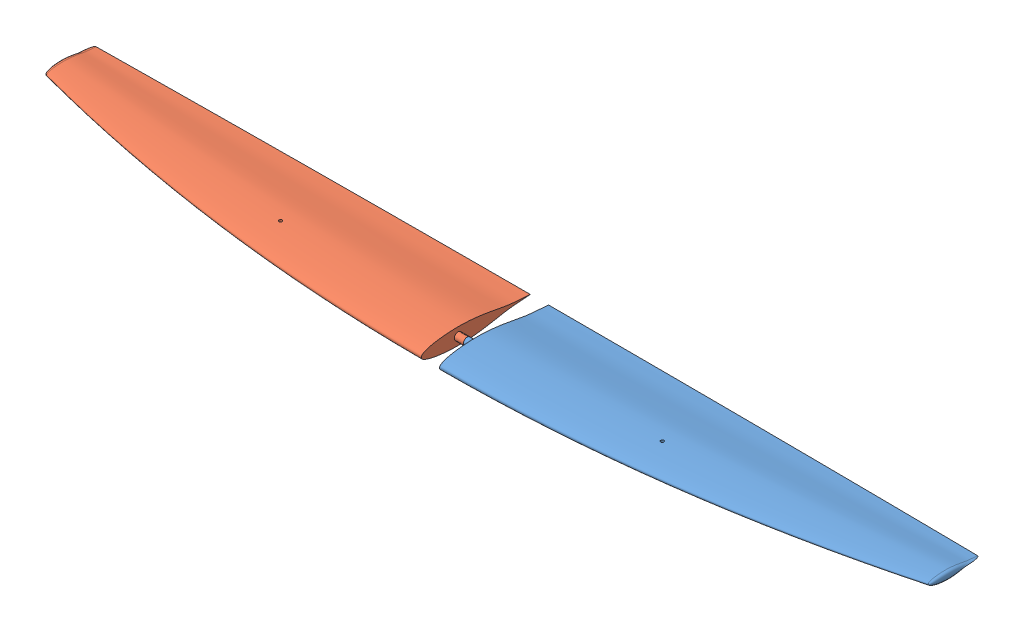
SolidWorks assembly Gouverne de profondeur.sldasm, configuration Défaut (file format 10000). Lengths in mm.
Overall size (2934.01 54.19 359.75).
2 component instances, 2 part files, 4 mates.
Components (placement in the parent):
- Gouverne de profondeur gauche-1: Gouverne de profondeur gauche.SLDPRT [Default] at (30 0 -4.5395) size (1467 54.19 359.75)
- Gouverne de profondeur droit-1: Gouverne de profondeur droit.SLDPRT [Default] at (-30 0 -4.5395) x (-1 0 0) z (0 0 -1) size (1467 54.19 359.75)
Mates (geometry in assembly coordinates):
- Coïncidente1: coincident anti-aligned: plane of Gouverne de profondeur gauche-1 through (-86.2899 0 70.4605) normal (-1 0 0); plane of Gouverne de profondeur droit-1 through (-86.2899 0 70.4605) normal (1 0 0)
- Coaxiale1: concentric anti-aligned: cylinder of Gouverne de profondeur gauche-1 through (-86.2899 0 70.4605) axis (1 0 0) radius 12.5; cylinder of Gouverne de profondeur droit-1 through (-86.2899 0 70.4605) axis (-1 0 0) radius 12.5
- Coïncidente2: coincident aligned: plane of Gouverne de profondeur gauche-1 through (-56.2899 0 -4.5395) normal (0 1 0); plane of Gouverne de profondeur droit-1
- Coïncidente3: coincident anti-aligned: circle of Gouverne de profondeur gauche-1; plane of assembly
